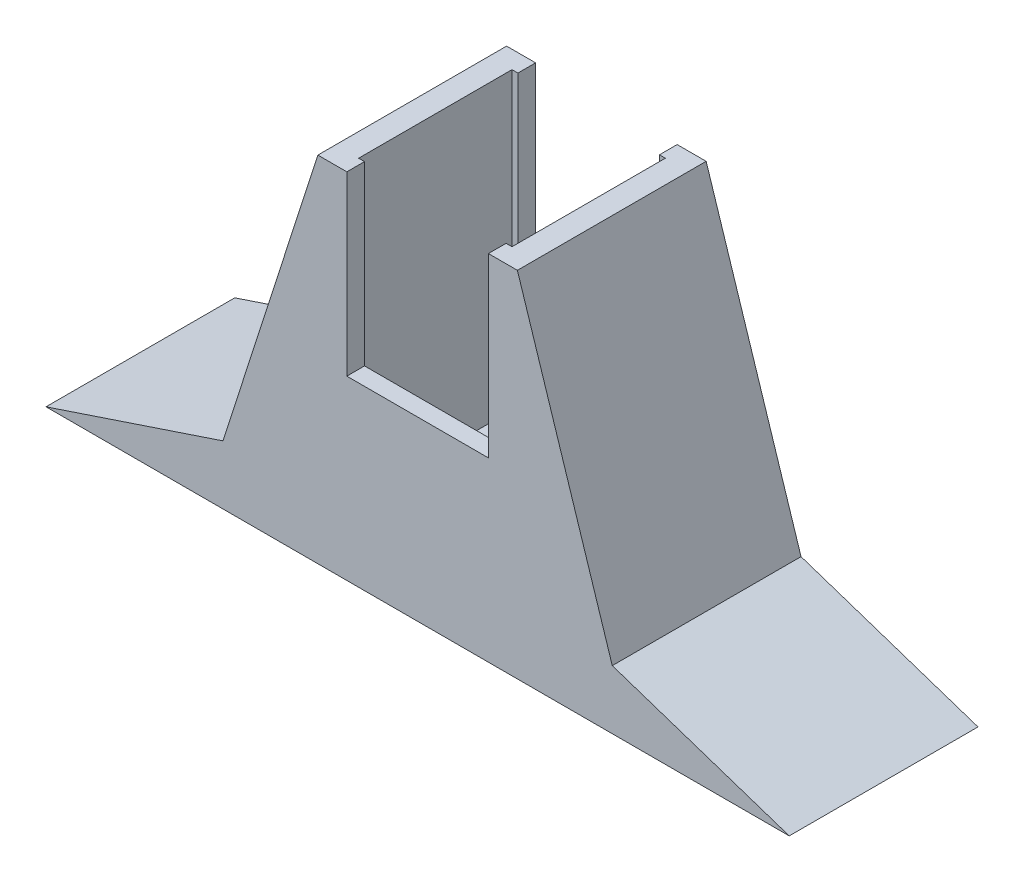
ISO-10303-21;
HEADER;
FILE_DESCRIPTION(('STEP AP214'),'2;1');
FILE_NAME('part.step','',(''),(''),'','','');
FILE_SCHEMA(('AUTOMOTIVE_DESIGN { 1 0 10303 214 1 1 1 1 }'));
ENDSEC;
DATA;
#1=APPLICATION_CONTEXT('core data for automotive mechanical design processes');
#2=APPLICATION_PROTOCOL_DEFINITION('international standard','automotive_design',2000,#1);
#3=PRODUCT_CONTEXT('',#1,'mechanical');
#4=PRODUCT('Part','Part','',(#3));
#5=PRODUCT_RELATED_PRODUCT_CATEGORY('part','',(#4));
#6=PRODUCT_DEFINITION_FORMATION('','',#4);
#7=PRODUCT_DEFINITION_CONTEXT('part definition',#1,'design');
#8=PRODUCT_DEFINITION('design','',#6,#7);
#9=PRODUCT_DEFINITION_SHAPE('','',#8);
#10=(LENGTH_UNIT() NAMED_UNIT(*) SI_UNIT(.MILLI.,.METRE.));
#11=(NAMED_UNIT(*) PLANE_ANGLE_UNIT() SI_UNIT($,.RADIAN.));
#12=(NAMED_UNIT(*) SI_UNIT($,.STERADIAN.) SOLID_ANGLE_UNIT());
#13=UNCERTAINTY_MEASURE_WITH_UNIT(LENGTH_MEASURE(1.E-05),#10,'distance_accuracy_value','');
#14=(GEOMETRIC_REPRESENTATION_CONTEXT(3) GLOBAL_UNCERTAINTY_ASSIGNED_CONTEXT((#13)) GLOBAL_UNIT_ASSIGNED_CONTEXT((#10,
#11,#12)) REPRESENTATION_CONTEXT('',''));
#15=CARTESIAN_POINT('',(0.,0.,0.));
#16=DIRECTION('',(0.,0.,1.));
#17=DIRECTION('',(1.,0.,0.));
#18=AXIS2_PLACEMENT_3D('',#15,#16,#17);
#19=CARTESIAN_POINT('',(-8.45753925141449,30.,16.));
#20=DIRECTION('',(0.,1.,0.));
#21=DIRECTION('',(0.,0.,1.));
#22=AXIS2_PLACEMENT_3D('',#19,#20,#21);
#23=PLANE('',#22);
#24=DIRECTION('',(1.,0.,0.));
#25=VECTOR('',#24,1.);
#26=CARTESIAN_POINT('',(-8.45753925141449,30.,16.));
#27=LINE('',#26,#25);
#28=CARTESIAN_POINT('',(-8.45753925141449,30.,16.));
#29=VERTEX_POINT('',#28);
#30=CARTESIAN_POINT('',(-6.,30.,16.));
#31=VERTEX_POINT('',#30);
#32=EDGE_CURVE('E281',#29,#31,#27,.T.);
#33=ORIENTED_EDGE('',*,*,#32,.T.);
#34=DIRECTION('',(0.,0.,1.));
#35=VECTOR('',#34,1.);
#36=CARTESIAN_POINT('',(-6.,30.,-9.));
#37=LINE('',#36,#35);
#38=CARTESIAN_POINT('',(-6.,30.,14.5));
#39=VERTEX_POINT('',#38);
#40=EDGE_CURVE('E226',#39,#31,#37,.T.);
#41=ORIENTED_EDGE('',*,*,#40,.F.);
#42=DIRECTION('',(1.,0.,0.));
#43=VECTOR('',#42,1.);
#44=CARTESIAN_POINT('',(-6.5,30.,14.5));
#45=LINE('',#44,#43);
#46=CARTESIAN_POINT('',(-6.5,30.,14.5));
#47=VERTEX_POINT('',#46);
#48=EDGE_CURVE('E262',#47,#39,#45,.T.);
#49=ORIENTED_EDGE('',*,*,#48,.F.);
#50=DIRECTION('',(0.,0.,-1.));
#51=VECTOR('',#50,1.);
#52=CARTESIAN_POINT('',(-6.5,30.,14.5));
#53=LINE('',#52,#51);
#54=CARTESIAN_POINT('',(-6.5,30.,1.5));
#55=VERTEX_POINT('',#54);
#56=EDGE_CURVE('E254',#47,#55,#53,.T.);
#57=ORIENTED_EDGE('',*,*,#56,.T.);
#58=DIRECTION('',(1.,0.,0.));
#59=VECTOR('',#58,1.);
#60=CARTESIAN_POINT('',(-6.5,30.,1.5));
#61=LINE('',#60,#59);
#62=CARTESIAN_POINT('',(-6.,30.,1.5));
#63=VERTEX_POINT('',#62);
#64=EDGE_CURVE('E268',#55,#63,#61,.T.);
#65=ORIENTED_EDGE('',*,*,#64,.T.);
#66=CARTESIAN_POINT('',(-6.,30.,0.));
#67=VERTEX_POINT('',#66);
#68=EDGE_CURVE('E228',#67,#63,#37,.T.);
#69=ORIENTED_EDGE('',*,*,#68,.F.);
#70=DIRECTION('',(1.,0.,0.));
#71=VECTOR('',#70,1.);
#72=CARTESIAN_POINT('',(-8.45753925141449,30.,0.));
#73=LINE('',#72,#71);
#74=CARTESIAN_POINT('',(-8.45753925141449,30.,0.));
#75=VERTEX_POINT('',#74);
#76=EDGE_CURVE('E186',#75,#67,#73,.T.);
#77=ORIENTED_EDGE('',*,*,#76,.F.);
#78=DIRECTION('',(0.,0.,-1.));
#79=VECTOR('',#78,1.);
#80=CARTESIAN_POINT('',(-8.45753925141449,30.,16.));
#81=LINE('',#80,#79);
#82=EDGE_CURVE('E205',#29,#75,#81,.T.);
#83=ORIENTED_EDGE('',*,*,#82,.F.);
#84=EDGE_LOOP('',(#33,#41,#49,#57,#65,#69,#77,#83));
#85=FACE_BOUND('',#84,.T.);
#86=ADVANCED_FACE('F33',(#85),#23,.T.);
#87=CARTESIAN_POINT('',(0.,0.,16.));
#88=DIRECTION('',(0.,0.,-1.));
#89=DIRECTION('',(-1.,0.,0.));
#90=AXIS2_PLACEMENT_3D('',#87,#88,#89);
#91=PLANE('',#90);
#92=ORIENTED_EDGE('',*,*,#32,.F.);
#93=DIRECTION('',(-0.306242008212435,-0.951953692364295,0.));
#94=VECTOR('',#93,1.);
#95=CARTESIAN_POINT('',(-16.5,4.99999999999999,16.));
#96=LINE('',#95,#94);
#97=CARTESIAN_POINT('',(-16.5,4.99999999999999,16.));
#98=VERTEX_POINT('',#97);
#99=EDGE_CURVE('E182',#29,#98,#96,.T.);
#100=ORIENTED_EDGE('',*,*,#99,.T.);
#101=DIRECTION('',(0.948683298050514,0.316227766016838,0.));
#102=VECTOR('',#101,1.);
#103=CARTESIAN_POINT('',(-31.5,0.,16.));
#104=LINE('',#103,#102);
#105=CARTESIAN_POINT('',(-31.5,0.,16.));
#106=VERTEX_POINT('',#105);
#107=EDGE_CURVE('E207',#106,#98,#104,.T.);
#108=ORIENTED_EDGE('',*,*,#107,.F.);
#109=DIRECTION('',(-1.,0.,0.));
#110=VECTOR('',#109,1.);
#111=CARTESIAN_POINT('',(31.5,0.,16.));
#112=LINE('',#111,#110);
#113=CARTESIAN_POINT('',(31.5,0.,16.));
#114=VERTEX_POINT('',#113);
#115=EDGE_CURVE('E286',#114,#106,#112,.T.);
#116=ORIENTED_EDGE('',*,*,#115,.F.);
#117=DIRECTION('',(-0.948683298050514,0.316227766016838,0.));
#118=VECTOR('',#117,1.);
#119=CARTESIAN_POINT('',(31.5,0.,16.));
#120=LINE('',#119,#118);
#121=CARTESIAN_POINT('',(16.5,4.99999999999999,16.));
#122=VERTEX_POINT('',#121);
#123=EDGE_CURVE('E284',#114,#122,#120,.T.);
#124=ORIENTED_EDGE('',*,*,#123,.T.);
#125=DIRECTION('',(-0.306242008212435,0.951953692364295,0.));
#126=VECTOR('',#125,1.);
#127=CARTESIAN_POINT('',(16.5,4.99999999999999,16.));
#128=LINE('',#127,#126);
#129=CARTESIAN_POINT('',(8.45753925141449,30.,16.));
#130=VERTEX_POINT('',#129);
#131=EDGE_CURVE('E163',#122,#130,#128,.T.);
#132=ORIENTED_EDGE('',*,*,#131,.T.);
#133=CARTESIAN_POINT('',(6.,30.,16.));
#134=VERTEX_POINT('',#133);
#135=EDGE_CURVE('E196',#134,#130,#27,.T.);
#136=ORIENTED_EDGE('',*,*,#135,.F.);
#137=DIRECTION('',(0.,1.,0.));
#138=VECTOR('',#137,1.);
#139=CARTESIAN_POINT('',(6.,0.,16.));
#140=LINE('',#139,#138);
#141=CARTESIAN_POINT('',(6.,15.,16.));
#142=VERTEX_POINT('',#141);
#143=EDGE_CURVE('E334',#142,#134,#140,.T.);
#144=ORIENTED_EDGE('',*,*,#143,.F.);
#145=DIRECTION('',(1.,0.,0.));
#146=VECTOR('',#145,1.);
#147=CARTESIAN_POINT('',(0.,15.,16.));
#148=LINE('',#147,#146);
#149=CARTESIAN_POINT('',(-6.,15.,16.));
#150=VERTEX_POINT('',#149);
#151=EDGE_CURVE('E333',#150,#142,#148,.T.);
#152=ORIENTED_EDGE('',*,*,#151,.F.);
#153=DIRECTION('',(0.,1.,0.));
#154=VECTOR('',#153,1.);
#155=CARTESIAN_POINT('',(-6.,0.,16.));
#156=LINE('',#155,#154);
#157=EDGE_CURVE('E234',#150,#31,#156,.T.);
#158=ORIENTED_EDGE('',*,*,#157,.T.);
#159=EDGE_LOOP('',(#92,#100,#108,#116,#124,#132,#136,#144,#152,#158));
#160=FACE_BOUND('',#159,.T.);
#161=ADVANCED_FACE('F297',(#160),#91,.F.);
#162=CARTESIAN_POINT('',(0.,0.,0.));
#163=DIRECTION('',(0.,0.,-1.));
#164=DIRECTION('',(-1.,0.,0.));
#165=AXIS2_PLACEMENT_3D('',#162,#163,#164);
#166=PLANE('',#165);
#167=DIRECTION('',(-0.306242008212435,-0.951953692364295,0.));
#168=VECTOR('',#167,1.);
#169=CARTESIAN_POINT('',(-16.5,4.99999999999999,0.));
#170=LINE('',#169,#168);
#171=CARTESIAN_POINT('',(-16.5,4.99999999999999,0.));
#172=VERTEX_POINT('',#171);
#173=EDGE_CURVE('E344',#75,#172,#170,.T.);
#174=ORIENTED_EDGE('',*,*,#173,.F.);
#175=ORIENTED_EDGE('',*,*,#76,.T.);
#176=DIRECTION('',(0.,-1.,0.));
#177=VECTOR('',#176,1.);
#178=CARTESIAN_POINT('',(-6.,0.,0.));
#179=LINE('',#178,#177);
#180=CARTESIAN_POINT('',(-6.,15.,0.));
#181=VERTEX_POINT('',#180);
#182=EDGE_CURVE('E241',#67,#181,#179,.T.);
#183=ORIENTED_EDGE('',*,*,#182,.T.);
#184=DIRECTION('',(-1.,0.,0.));
#185=VECTOR('',#184,1.);
#186=CARTESIAN_POINT('',(0.,15.,0.));
#187=LINE('',#186,#185);
#188=CARTESIAN_POINT('',(6.,15.,0.));
#189=VERTEX_POINT('',#188);
#190=EDGE_CURVE('E247',#189,#181,#187,.T.);
#191=ORIENTED_EDGE('',*,*,#190,.F.);
#192=DIRECTION('',(0.,-1.,0.));
#193=VECTOR('',#192,1.);
#194=CARTESIAN_POINT('',(6.,0.,0.));
#195=LINE('',#194,#193);
#196=CARTESIAN_POINT('',(6.,30.,0.));
#197=VERTEX_POINT('',#196);
#198=EDGE_CURVE('E237',#197,#189,#195,.T.);
#199=ORIENTED_EDGE('',*,*,#198,.F.);
#200=CARTESIAN_POINT('',(8.45753925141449,30.,0.));
#201=VERTEX_POINT('',#200);
#202=EDGE_CURVE('E180',#197,#201,#73,.T.);
#203=ORIENTED_EDGE('',*,*,#202,.T.);
#204=DIRECTION('',(-0.306242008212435,0.951953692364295,0.));
#205=VECTOR('',#204,1.);
#206=CARTESIAN_POINT('',(16.5,4.99999999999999,0.));
#207=LINE('',#206,#205);
#208=CARTESIAN_POINT('',(16.5,4.99999999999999,0.));
#209=VERTEX_POINT('',#208);
#210=EDGE_CURVE('E160',#209,#201,#207,.T.);
#211=ORIENTED_EDGE('',*,*,#210,.F.);
#212=DIRECTION('',(-0.948683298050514,0.316227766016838,0.));
#213=VECTOR('',#212,1.);
#214=CARTESIAN_POINT('',(31.5,0.,0.));
#215=LINE('',#214,#213);
#216=CARTESIAN_POINT('',(31.5,0.,0.));
#217=VERTEX_POINT('',#216);
#218=EDGE_CURVE('E176',#217,#209,#215,.T.);
#219=ORIENTED_EDGE('',*,*,#218,.F.);
#220=DIRECTION('',(-1.,0.,0.));
#221=VECTOR('',#220,1.);
#222=CARTESIAN_POINT('',(31.5,0.,0.));
#223=LINE('',#222,#221);
#224=CARTESIAN_POINT('',(-31.5,0.,0.));
#225=VERTEX_POINT('',#224);
#226=EDGE_CURVE('E185',#217,#225,#223,.T.);
#227=ORIENTED_EDGE('',*,*,#226,.T.);
#228=DIRECTION('',(0.948683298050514,0.316227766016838,0.));
#229=VECTOR('',#228,1.);
#230=CARTESIAN_POINT('',(-31.5,0.,0.));
#231=LINE('',#230,#229);
#232=EDGE_CURVE('E188',#225,#172,#231,.T.);
#233=ORIENTED_EDGE('',*,*,#232,.T.);
#234=EDGE_LOOP('',(#174,#175,#183,#191,#199,#203,#211,#219,#227,#233));
#235=FACE_BOUND('',#234,.T.);
#236=ADVANCED_FACE('F174',(#235),#166,.T.);
#237=CARTESIAN_POINT('',(-6.5,5.,14.5));
#238=DIRECTION('',(0.,0.,1.));
#239=DIRECTION('',(1.,0.,0.));
#240=AXIS2_PLACEMENT_3D('',#237,#238,#239);
#241=PLANE('',#240);
#242=DIRECTION('',(0.,1.,0.));
#243=VECTOR('',#242,1.);
#244=CARTESIAN_POINT('',(-6.,5.,14.5));
#245=LINE('',#244,#243);
#246=CARTESIAN_POINT('',(-6.,15.,14.5));
#247=VERTEX_POINT('',#246);
#248=EDGE_CURVE('E239',#247,#39,#245,.T.);
#249=ORIENTED_EDGE('',*,*,#248,.F.);
#250=DIRECTION('',(1.,0.,0.));
#251=VECTOR('',#250,1.);
#252=CARTESIAN_POINT('',(-6.5,15.,14.5));
#253=LINE('',#252,#251);
#254=CARTESIAN_POINT('',(6.,15.,14.5));
#255=VERTEX_POINT('',#254);
#256=EDGE_CURVE('E244',#247,#255,#253,.T.);
#257=ORIENTED_EDGE('',*,*,#256,.T.);
#258=DIRECTION('',(0.,1.,0.));
#259=VECTOR('',#258,1.);
#260=CARTESIAN_POINT('',(6.,5.,14.5));
#261=LINE('',#260,#259);
#262=CARTESIAN_POINT('',(6.,30.,14.5));
#263=VERTEX_POINT('',#262);
#264=EDGE_CURVE('E235',#255,#263,#261,.T.);
#265=ORIENTED_EDGE('',*,*,#264,.T.);
#266=CARTESIAN_POINT('',(6.5,30.,14.5));
#267=VERTEX_POINT('',#266);
#268=EDGE_CURVE('E249',#263,#267,#45,.T.);
#269=ORIENTED_EDGE('',*,*,#268,.T.);
#270=DIRECTION('',(0.,1.,0.));
#271=VECTOR('',#270,1.);
#272=CARTESIAN_POINT('',(6.5,5.,14.5));
#273=LINE('',#272,#271);
#274=CARTESIAN_POINT('',(6.5,5.,14.5));
#275=VERTEX_POINT('',#274);
#276=EDGE_CURVE('E261',#275,#267,#273,.T.);
#277=ORIENTED_EDGE('',*,*,#276,.F.);
#278=DIRECTION('',(1.,0.,0.));
#279=VECTOR('',#278,1.);
#280=CARTESIAN_POINT('',(-6.5,5.,14.5));
#281=LINE('',#280,#279);
#282=CARTESIAN_POINT('',(-6.5,5.,14.5));
#283=VERTEX_POINT('',#282);
#284=EDGE_CURVE('E250',#283,#275,#281,.T.);
#285=ORIENTED_EDGE('',*,*,#284,.F.);
#286=DIRECTION('',(0.,1.,0.));
#287=VECTOR('',#286,1.);
#288=CARTESIAN_POINT('',(-6.5,5.,14.5));
#289=LINE('',#288,#287);
#290=EDGE_CURVE('E273',#283,#47,#289,.T.);
#291=ORIENTED_EDGE('',*,*,#290,.T.);
#292=ORIENTED_EDGE('',*,*,#48,.T.);
#293=EDGE_LOOP('',(#249,#257,#265,#269,#277,#285,#291,#292));
#294=FACE_BOUND('',#293,.T.);
#295=ADVANCED_FACE('F307',(#294),#241,.F.);
#296=CARTESIAN_POINT('',(-6.5,5.,1.5));
#297=DIRECTION('',(0.,0.,1.));
#298=DIRECTION('',(1.,0.,0.));
#299=AXIS2_PLACEMENT_3D('',#296,#297,#298);
#300=PLANE('',#299);
#301=DIRECTION('',(1.,0.,0.));
#302=VECTOR('',#301,1.);
#303=CARTESIAN_POINT('',(-6.5,15.,1.5));
#304=LINE('',#303,#302);
#305=CARTESIAN_POINT('',(-6.,15.,1.5));
#306=VERTEX_POINT('',#305);
#307=CARTESIAN_POINT('',(6.,15.,1.5));
#308=VERTEX_POINT('',#307);
#309=EDGE_CURVE('E41',#306,#308,#304,.T.);
#310=ORIENTED_EDGE('',*,*,#309,.F.);
#311=DIRECTION('',(0.,1.,0.));
#312=VECTOR('',#311,1.);
#313=CARTESIAN_POINT('',(-6.,5.,1.5));
#314=LINE('',#313,#312);
#315=EDGE_CURVE('E11',#306,#63,#314,.T.);
#316=ORIENTED_EDGE('',*,*,#315,.T.);
#317=ORIENTED_EDGE('',*,*,#64,.F.);
#318=DIRECTION('',(0.,1.,0.));
#319=VECTOR('',#318,1.);
#320=CARTESIAN_POINT('',(-6.5,5.,1.5));
#321=LINE('',#320,#319);
#322=CARTESIAN_POINT('',(-6.5,5.,1.5));
#323=VERTEX_POINT('',#322);
#324=EDGE_CURVE('E275',#323,#55,#321,.T.);
#325=ORIENTED_EDGE('',*,*,#324,.F.);
#326=DIRECTION('',(1.,0.,0.));
#327=VECTOR('',#326,1.);
#328=CARTESIAN_POINT('',(-6.5,5.,1.5));
#329=LINE('',#328,#327);
#330=CARTESIAN_POINT('',(6.5,5.,1.5));
#331=VERTEX_POINT('',#330);
#332=EDGE_CURVE('E257',#323,#331,#329,.T.);
#333=ORIENTED_EDGE('',*,*,#332,.T.);
#334=DIRECTION('',(0.,1.,0.));
#335=VECTOR('',#334,1.);
#336=CARTESIAN_POINT('',(6.5,5.,1.5));
#337=LINE('',#336,#335);
#338=CARTESIAN_POINT('',(6.5,30.,1.5));
#339=VERTEX_POINT('',#338);
#340=EDGE_CURVE('E277',#331,#339,#337,.T.);
#341=ORIENTED_EDGE('',*,*,#340,.T.);
#342=CARTESIAN_POINT('',(6.,30.,1.5));
#343=VERTEX_POINT('',#342);
#344=EDGE_CURVE('E220',#343,#339,#61,.T.);
#345=ORIENTED_EDGE('',*,*,#344,.F.);
#346=DIRECTION('',(0.,1.,0.));
#347=VECTOR('',#346,1.);
#348=CARTESIAN_POINT('',(6.,5.,1.5));
#349=LINE('',#348,#347);
#350=EDGE_CURVE('E200',#308,#343,#349,.T.);
#351=ORIENTED_EDGE('',*,*,#350,.F.);
#352=EDGE_LOOP('',(#310,#316,#317,#325,#333,#341,#345,#351));
#353=FACE_BOUND('',#352,.T.);
#354=ADVANCED_FACE('F218',(#353),#300,.T.);
#355=CARTESIAN_POINT('',(-31.5,0.,16.));
#356=DIRECTION('',(-0.316227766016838,0.948683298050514,0.));
#357=DIRECTION('',(-0.948683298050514,-0.316227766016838,0.));
#358=AXIS2_PLACEMENT_3D('',#355,#356,#357);
#359=PLANE('',#358);
#360=ORIENTED_EDGE('',*,*,#232,.F.);
#361=DIRECTION('',(0.,0.,-1.));
#362=VECTOR('',#361,1.);
#363=CARTESIAN_POINT('',(-31.5,0.,16.));
#364=LINE('',#363,#362);
#365=EDGE_CURVE('E201',#106,#225,#364,.T.);
#366=ORIENTED_EDGE('',*,*,#365,.F.);
#367=ORIENTED_EDGE('',*,*,#107,.T.);
#368=DIRECTION('',(0.,0.,-1.));
#369=VECTOR('',#368,1.);
#370=CARTESIAN_POINT('',(-16.5,4.99999999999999,16.));
#371=LINE('',#370,#369);
#372=EDGE_CURVE('E197',#98,#172,#371,.T.);
#373=ORIENTED_EDGE('',*,*,#372,.T.);
#374=EDGE_LOOP('',(#360,#366,#367,#373));
#375=FACE_BOUND('',#374,.T.);
#376=ADVANCED_FACE('F292',(#375),#359,.T.);
#377=CARTESIAN_POINT('',(31.5,0.,16.));
#378=DIRECTION('',(0.,-1.,0.));
#379=DIRECTION('',(0.,0.,-1.));
#380=AXIS2_PLACEMENT_3D('',#377,#378,#379);
#381=PLANE('',#380);
#382=ORIENTED_EDGE('',*,*,#226,.F.);
#383=DIRECTION('',(0.,0.,-1.));
#384=VECTOR('',#383,1.);
#385=CARTESIAN_POINT('',(31.5,0.,16.));
#386=LINE('',#385,#384);
#387=EDGE_CURVE('E168',#114,#217,#386,.T.);
#388=ORIENTED_EDGE('',*,*,#387,.F.);
#389=ORIENTED_EDGE('',*,*,#115,.T.);
#390=ORIENTED_EDGE('',*,*,#365,.T.);
#391=EDGE_LOOP('',(#382,#388,#389,#390));
#392=FACE_BOUND('',#391,.T.);
#393=ADVANCED_FACE('F299',(#392),#381,.T.);
#394=CARTESIAN_POINT('',(31.5,0.,16.));
#395=DIRECTION('',(-0.316227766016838,-0.948683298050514,0.));
#396=DIRECTION('',(0.948683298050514,-0.316227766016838,0.));
#397=AXIS2_PLACEMENT_3D('',#394,#395,#396);
#398=PLANE('',#397);
#399=ORIENTED_EDGE('',*,*,#218,.T.);
#400=DIRECTION('',(0.,0.,-1.));
#401=VECTOR('',#400,1.);
#402=CARTESIAN_POINT('',(16.5,4.99999999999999,16.));
#403=LINE('',#402,#401);
#404=EDGE_CURVE('E157',#122,#209,#403,.T.);
#405=ORIENTED_EDGE('',*,*,#404,.F.);
#406=ORIENTED_EDGE('',*,*,#123,.F.);
#407=ORIENTED_EDGE('',*,*,#387,.T.);
#408=EDGE_LOOP('',(#399,#405,#406,#407));
#409=FACE_BOUND('',#408,.T.);
#410=ADVANCED_FACE('F184',(#409),#398,.F.);
#411=DIRECTION('',(0.,0.,1.));
#412=VECTOR('',#411,1.);
#413=CARTESIAN_POINT('',(6.,30.,-9.));
#414=LINE('',#413,#412);
#415=EDGE_CURVE('E48',#263,#134,#414,.T.);
#416=ORIENTED_EDGE('',*,*,#415,.T.);
#417=ORIENTED_EDGE('',*,*,#135,.T.);
#418=DIRECTION('',(0.,0.,-1.));
#419=VECTOR('',#418,1.);
#420=CARTESIAN_POINT('',(8.45753925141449,30.,16.));
#421=LINE('',#420,#419);
#422=EDGE_CURVE('E169',#130,#201,#421,.T.);
#423=ORIENTED_EDGE('',*,*,#422,.T.);
#424=ORIENTED_EDGE('',*,*,#202,.F.);
#425=EDGE_CURVE('E223',#197,#343,#414,.T.);
#426=ORIENTED_EDGE('',*,*,#425,.T.);
#427=ORIENTED_EDGE('',*,*,#344,.T.);
#428=DIRECTION('',(0.,0.,-1.));
#429=VECTOR('',#428,1.);
#430=CARTESIAN_POINT('',(6.5,30.,14.5));
#431=LINE('',#430,#429);
#432=EDGE_CURVE('E265',#267,#339,#431,.T.);
#433=ORIENTED_EDGE('',*,*,#432,.F.);
#434=ORIENTED_EDGE('',*,*,#268,.F.);
#435=EDGE_LOOP('',(#416,#417,#423,#424,#426,#427,#433,#434));
#436=FACE_BOUND('',#435,.T.);
#437=ADVANCED_FACE('F35',(#436),#23,.T.);
#438=CARTESIAN_POINT('',(-6.5,5.,14.5));
#439=DIRECTION('',(1.,0.,0.));
#440=DIRECTION('',(0.,0.,-1.));
#441=AXIS2_PLACEMENT_3D('',#438,#439,#440);
#442=PLANE('',#441);
#443=ORIENTED_EDGE('',*,*,#56,.F.);
#444=ORIENTED_EDGE('',*,*,#290,.F.);
#445=DIRECTION('',(0.,0.,-1.));
#446=VECTOR('',#445,1.);
#447=CARTESIAN_POINT('',(-6.5,5.,14.5));
#448=LINE('',#447,#446);
#449=EDGE_CURVE('E259',#283,#323,#448,.T.);
#450=ORIENTED_EDGE('',*,*,#449,.T.);
#451=ORIENTED_EDGE('',*,*,#324,.T.);
#452=EDGE_LOOP('',(#443,#444,#450,#451));
#453=FACE_BOUND('',#452,.T.);
#454=ADVANCED_FACE('F320',(#453),#442,.T.);
#455=CARTESIAN_POINT('',(6.5,5.,14.5));
#456=DIRECTION('',(1.,0.,0.));
#457=DIRECTION('',(0.,0.,-1.));
#458=AXIS2_PLACEMENT_3D('',#455,#456,#457);
#459=PLANE('',#458);
#460=ORIENTED_EDGE('',*,*,#432,.T.);
#461=ORIENTED_EDGE('',*,*,#340,.F.);
#462=DIRECTION('',(0.,0.,-1.));
#463=VECTOR('',#462,1.);
#464=CARTESIAN_POINT('',(6.5,5.,14.5));
#465=LINE('',#464,#463);
#466=EDGE_CURVE('E253',#275,#331,#465,.T.);
#467=ORIENTED_EDGE('',*,*,#466,.F.);
#468=ORIENTED_EDGE('',*,*,#276,.T.);
#469=EDGE_LOOP('',(#460,#461,#467,#468));
#470=FACE_BOUND('',#469,.T.);
#471=ADVANCED_FACE('F311',(#470),#459,.F.);
#472=CARTESIAN_POINT('',(0.,5.,0.));
#473=DIRECTION('',(0.,1.,0.));
#474=DIRECTION('',(0.,0.,1.));
#475=AXIS2_PLACEMENT_3D('',#472,#473,#474);
#476=PLANE('',#475);
#477=ORIENTED_EDGE('',*,*,#284,.T.);
#478=ORIENTED_EDGE('',*,*,#466,.T.);
#479=ORIENTED_EDGE('',*,*,#332,.F.);
#480=ORIENTED_EDGE('',*,*,#449,.F.);
#481=EDGE_LOOP('',(#477,#478,#479,#480));
#482=FACE_BOUND('',#481,.T.);
#483=ADVANCED_FACE('F316',(#482),#476,.T.);
#484=CARTESIAN_POINT('',(-6.,0.,-9.));
#485=DIRECTION('',(1.,0.,0.));
#486=DIRECTION('',(0.,0.,-1.));
#487=AXIS2_PLACEMENT_3D('',#484,#485,#486);
#488=PLANE('',#487);
#489=ORIENTED_EDGE('',*,*,#68,.T.);
#490=ORIENTED_EDGE('',*,*,#315,.F.);
#491=DIRECTION('',(0.,0.,1.));
#492=VECTOR('',#491,1.);
#493=CARTESIAN_POINT('',(-6.,15.,-9.));
#494=LINE('',#493,#492);
#495=EDGE_CURVE('E215',#181,#306,#494,.T.);
#496=ORIENTED_EDGE('',*,*,#495,.F.);
#497=ORIENTED_EDGE('',*,*,#182,.F.);
#498=EDGE_LOOP('',(#489,#490,#496,#497));
#499=FACE_BOUND('',#498,.T.);
#500=ADVANCED_FACE('F342',(#499),#488,.T.);
#501=CARTESIAN_POINT('',(6.,0.,-9.));
#502=DIRECTION('',(1.,0.,0.));
#503=DIRECTION('',(0.,0.,-1.));
#504=AXIS2_PLACEMENT_3D('',#501,#502,#503);
#505=PLANE('',#504);
#506=ORIENTED_EDGE('',*,*,#198,.T.);
#507=DIRECTION('',(0.,0.,1.));
#508=VECTOR('',#507,1.);
#509=CARTESIAN_POINT('',(6.,15.,-9.));
#510=LINE('',#509,#508);
#511=EDGE_CURVE('E56',#189,#308,#510,.T.);
#512=ORIENTED_EDGE('',*,*,#511,.T.);
#513=ORIENTED_EDGE('',*,*,#350,.T.);
#514=ORIENTED_EDGE('',*,*,#425,.F.);
#515=EDGE_LOOP('',(#506,#512,#513,#514));
#516=FACE_BOUND('',#515,.T.);
#517=ADVANCED_FACE('F222',(#516),#505,.F.);
#518=CARTESIAN_POINT('',(0.,15.,-9.));
#519=DIRECTION('',(0.,-1.,0.));
#520=DIRECTION('',(1.,0.,0.));
#521=AXIS2_PLACEMENT_3D('',#518,#519,#520);
#522=PLANE('',#521);
#523=ORIENTED_EDGE('',*,*,#190,.T.);
#524=ORIENTED_EDGE('',*,*,#495,.T.);
#525=ORIENTED_EDGE('',*,*,#309,.T.);
#526=ORIENTED_EDGE('',*,*,#511,.F.);
#527=EDGE_LOOP('',(#523,#524,#525,#526));
#528=FACE_BOUND('',#527,.T.);
#529=ADVANCED_FACE('F212',(#528),#522,.F.);
#530=EDGE_CURVE('E338',#247,#150,#494,.T.);
#531=ORIENTED_EDGE('',*,*,#530,.T.);
#532=ORIENTED_EDGE('',*,*,#151,.T.);
#533=EDGE_CURVE('E232',#255,#142,#510,.T.);
#534=ORIENTED_EDGE('',*,*,#533,.F.);
#535=ORIENTED_EDGE('',*,*,#256,.F.);
#536=EDGE_LOOP('',(#531,#532,#534,#535));
#537=FACE_BOUND('',#536,.T.);
#538=ADVANCED_FACE('F349',(#537),#522,.F.);
#539=ORIENTED_EDGE('',*,*,#248,.T.);
#540=ORIENTED_EDGE('',*,*,#40,.T.);
#541=ORIENTED_EDGE('',*,*,#157,.F.);
#542=ORIENTED_EDGE('',*,*,#530,.F.);
#543=EDGE_LOOP('',(#539,#540,#541,#542));
#544=FACE_BOUND('',#543,.T.);
#545=ADVANCED_FACE('F329',(#544),#488,.T.);
#546=ORIENTED_EDGE('',*,*,#533,.T.);
#547=ORIENTED_EDGE('',*,*,#143,.T.);
#548=ORIENTED_EDGE('',*,*,#415,.F.);
#549=ORIENTED_EDGE('',*,*,#264,.F.);
#550=EDGE_LOOP('',(#546,#547,#548,#549));
#551=FACE_BOUND('',#550,.T.);
#552=ADVANCED_FACE('F350',(#551),#505,.F.);
#553=CARTESIAN_POINT('',(-16.5,4.99999999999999,0.));
#554=DIRECTION('',(-0.951953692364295,0.306242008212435,0.));
#555=DIRECTION('',(-0.306242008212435,-0.951953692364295,0.));
#556=AXIS2_PLACEMENT_3D('',#553,#554,#555);
#557=PLANE('',#556);
#558=ORIENTED_EDGE('',*,*,#99,.F.);
#559=ORIENTED_EDGE('',*,*,#82,.T.);
#560=ORIENTED_EDGE('',*,*,#173,.T.);
#561=ORIENTED_EDGE('',*,*,#372,.F.);
#562=EDGE_LOOP('',(#558,#559,#560,#561));
#563=FACE_BOUND('',#562,.T.);
#564=ADVANCED_FACE('F352',(#563),#557,.T.);
#565=CARTESIAN_POINT('',(16.5,4.99999999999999,0.));
#566=DIRECTION('',(0.951953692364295,0.306242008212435,0.));
#567=DIRECTION('',(-0.306242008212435,0.951953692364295,0.));
#568=AXIS2_PLACEMENT_3D('',#565,#566,#567);
#569=PLANE('',#568);
#570=ORIENTED_EDGE('',*,*,#131,.F.);
#571=ORIENTED_EDGE('',*,*,#404,.T.);
#572=ORIENTED_EDGE('',*,*,#210,.T.);
#573=ORIENTED_EDGE('',*,*,#422,.F.);
#574=EDGE_LOOP('',(#570,#571,#572,#573));
#575=FACE_BOUND('',#574,.T.);
#576=ADVANCED_FACE('F159',(#575),#569,.T.);
#577=CLOSED_SHELL('',(#86,#161,#236,#295,#354,#376,#393,#410,#437,#454,#471,#483,#500,#517,#529,
#538,#545,#552,#564,#576));
#578=MANIFOLD_SOLID_BREP('B2',#577);
#579=ADVANCED_BREP_SHAPE_REPRESENTATION('',(#18,#578),#14);
#580=SHAPE_DEFINITION_REPRESENTATION(#9,#579);
ENDSEC;
END-ISO-10303-21;
